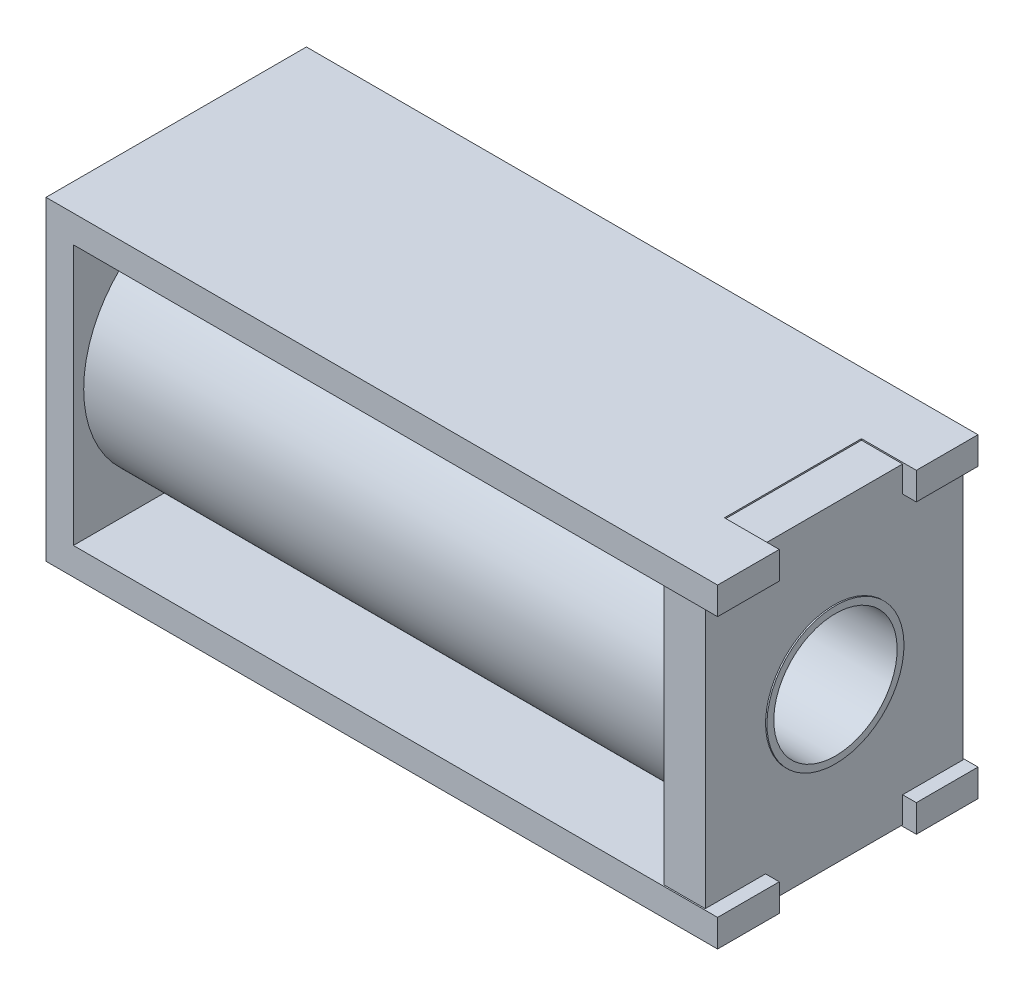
from build123d import *

# Parameters (mm, degrees)
BOSS_EXTRU_1_DEPTH      = 9.5
BOSS_EXTRU_1_DEPTH_BACK = 9.5
ENL_V_MAT_EXTRU_3_REACH = 53.22
ESQUISSE9_R             = 2.5
ESQUISSE2_W             = 10
ESQUISSE2_H             = 2
ENL_V_MAT_EXTRU_1_DEPTH = 4
BOSS_EXTRU_2_DEPTH      = 3
ENL_V_MAT_EXTRU_2_REACH = 52.264
ESQUISSE5_R             = 5
BOSS_EXTRU_3_REACH      = 49.503
ESQUISSE10_R            = 8.75
ESQUISSE10_R_2          = 5


with BuildPart() as part:
    # Esquisse1 → Boss.-Extru.1 (new, two sides: drawn at the far end of the back side and taken through both)
    with BuildSketch(Plane.XY.offset(-BOSS_EXTRU_1_DEPTH_BACK)):
        Polygon((0, -11.5), (0, 11.5), (49, 11.5), (49, 9.5), (2, 9.5), (2, -9.5), (49, -9.5), (49, -11.5), align=None)
    extrude(amount=BOSS_EXTRU_1_DEPTH + BOSS_EXTRU_1_DEPTH_BACK)

    # Esquisse9 → Enl_v. mat.-Extru.3 (cut, up to next)
    with BuildSketch(Plane.ZY, mode=Mode.PRIVATE) as enl_v_mat_extru_3_sk1:
        Circle(ESQUISSE9_R)
    enl_v_mat_extru_3_tool1 = extrude(enl_v_mat_extru_3_sk1.sketch, amount=-ENL_V_MAT_EXTRU_3_REACH, mode=Mode.PRIVATE) & part.part
    add(enl_v_mat_extru_3_tool1.solids().sort_by_distance((0, 0, 0))[0], mode=Mode.SUBTRACT)

    # Esquisse2 → Enl_v. mat.-Extru.1 (cut)
    with BuildSketch(Plane(origin=(49, 0, 0), x_dir=(0, 0, -1), z_dir=(1, 0, 0))):
        with Locations((0, 10.5)):
            Rectangle(ESQUISSE2_W, ESQUISSE2_H)
        with Locations((0, -10.5)):
            Rectangle(ESQUISSE2_W, ESQUISSE2_H)
    extrude(amount=-ENL_V_MAT_EXTRU_1_DEPTH, mode=Mode.SUBTRACT)

    # Esquisse4 → Boss.-Extru.2 (add)
    with BuildSketch(Plane(origin=(45, 0, 0), x_dir=(0, 0, -1), z_dir=(1, 0, 0))):
        Polygon((-5, 11.4), (-5, 9.5), (-9.4, 9.5), (-9.4, -9.5), (-5, -9.5), (-5, -11.4), (5, -11.4), (5, -9.5), (9.4, -9.5), (9.4, 9.5), (5, 9.5), (5, 11.4), align=None)
    extrude(amount=BOSS_EXTRU_2_DEPTH)

    # Esquisse5 → Enl_v. mat.-Extru.2 (cut, up to next)
    with BuildSketch(Plane(origin=(48, 0, 0), x_dir=(0, 0, -1), z_dir=(1, 0, 0)), mode=Mode.PRIVATE) as enl_v_mat_extru_2_sk1:
        Circle(ESQUISSE5_R)
    enl_v_mat_extru_2_tool1 = extrude(enl_v_mat_extru_2_sk1.sketch, amount=-ENL_V_MAT_EXTRU_2_REACH, mode=Mode.PRIVATE) & part.part
    add(enl_v_mat_extru_2_tool1.solids().sort_by_distance((48, 0, 0))[0], mode=Mode.SUBTRACT)

    # Esquisse8 → R_volution1 (revolve)
    with BuildSketch(Plane.XY, mode=Mode.PRIVATE) as r_volution1_sk:
        Polygon((48.1, 5), (2, 5), (2, 2.5), (-0.1, 2.5), (-0.1, 0), (9.6, 0), (9.6, 2.5), (17.6, 3.75), (17.6, 4.5), (48.1, 4.5), align=None)
    revolve(r_volution1_sk.sketch.rotate(Axis((-0.1, 0, 0), (1, 0, 0)), 180), axis=Axis((-0.1, 0, 0), (1, 0, 0)))

    # Esquisse10 → Boss.-Extru.3 (add, up to next)
    with BuildSketch(Plane.ZY.offset(-45), mode=Mode.PRIVATE) as boss_extru_3_sk1:
        with Locations(Location((0, 0, 0), (0, 0, 180))):
            Circle(ESQUISSE10_R)
        with Locations(Location((0, 0, 0), (0, 0, 270))):
            Circle(ESQUISSE10_R_2, mode=Mode.SUBTRACT)
    boss_extru_3_tool1 = extrude(boss_extru_3_sk1.sketch, amount=BOSS_EXTRU_3_REACH, mode=Mode.PRIVATE) - part.part
    add(boss_extru_3_tool1.solids().sort_by_distance((45, 0, 8.502513))[0])


solid = part.part
